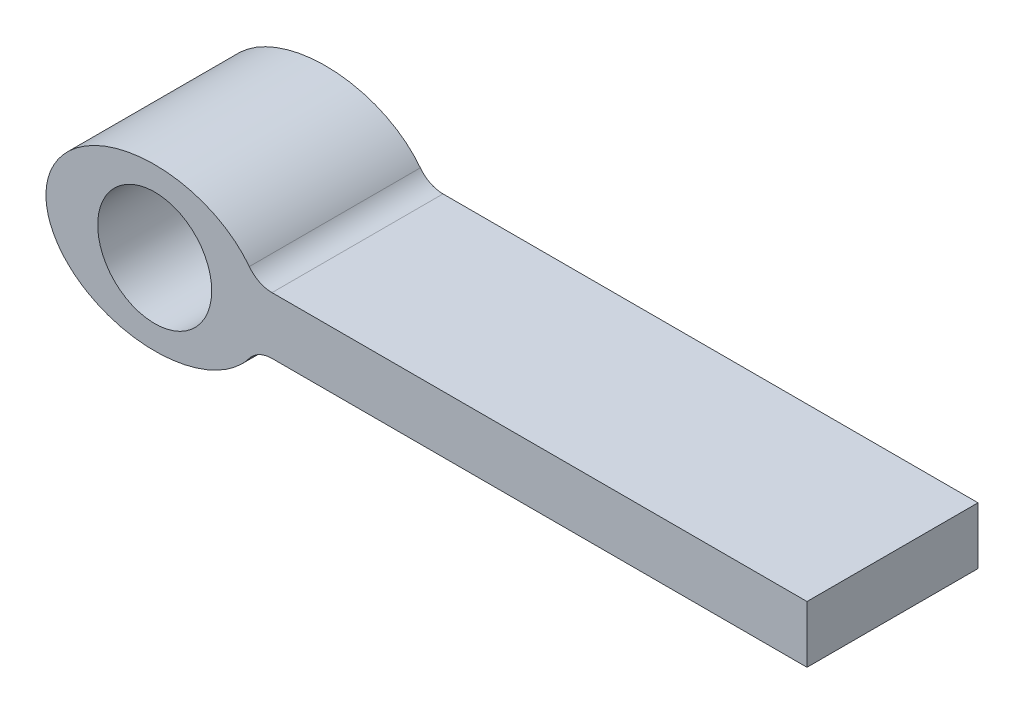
from build123d import *

# Parameters (mm, degrees)
SZKIC1_R                    = 4
DODANIE_WYCI_GNI_CIE1_DEPTH = 6


with BuildPart() as part:
    # Szkic1 → Dodanie-wyci_gni_cie1 (new, symmetric)
    with BuildSketch(Plane.XY):
        with BuildLine():
            Line((8.233099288, 2), (45.776749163, 2))
            Line((45.776749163, 2), (45.776749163, -2))
            Line((45.776749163, -2), (8.233099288, -2))
            ThreePointArc((8.233099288, -2), (7.345013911, -2.207988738), (6.641640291, -2.788695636))
            add(Edge.make_bspline(
                [(6.641640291, 2.788695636), (2.13946651, 8.70382744), (-4.886424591, 4.35191372), (-11.912315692, 0), (-4.886424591, -4.35191372), (2.13946651, -8.70382744), (6.641640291, -2.788695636)],
                knots=[3.65611921, 3.65611921, 3.65611921, 5.407496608, 5.407496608, 7.158874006, 7.158874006, 8.910251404, 8.910251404, 8.910251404], degree=2, weights=[1, 0.6404681, 1, 0.6404681, 1, 0.6404681, 1]))
            ThreePointArc((6.641640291, 2.788695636), (7.345013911, 2.207988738), (8.233099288, 2))
        make_face()
        Circle(SZKIC1_R, mode=Mode.SUBTRACT)
    extrude(amount=DODANIE_WYCI_GNI_CIE1_DEPTH, both=True)


solid = part.part
